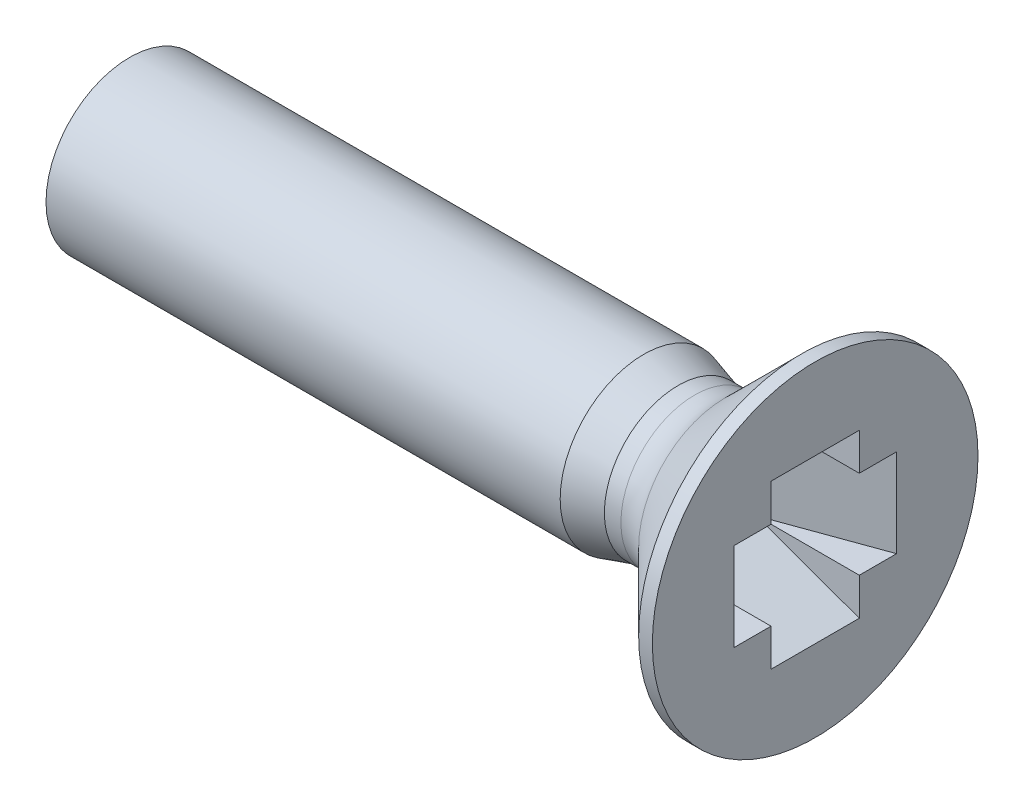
from build123d import *

# Parameters (mm, degrees)
EXTRUSION1_DEPTH = 1.03
EXTRUSION2_DEPTH = 1.03
EXTRUSION3_DEPTH = 1.03
CONG_1_R         = 0.5


with BuildPart() as part:
    # Esquisse1 → R_volution1 (revolve)
    with BuildSketch(Plane(origin=(0, 0, 0), x_dir=(-1, 0, 0), z_dir=(0, 0, -1)), mode=Mode.PRIVATE) as r_volution1_sk:
        Polygon((0, 1.9), (0, 0), (8, 0), (8, 0.975609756), (2, 0.975609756), (1.6, 0.86), (1.2, 0.86), (0.16, 1.9), align=None)
    revolve(r_volution1_sk.sketch.rotate(Axis((0, 0, 0), (-1, 0, 0)), 270), axis=Axis((0, 0, 0), (-1, 0, 0)))

    # Esquisse2 → Extrusion1 (cut)
    with BuildSketch(Plane.XY.offset(0.515)):
        Polygon((0, -0.95), (0, 0.95), (-1.2, 0.515), (-1.2, -0.515), align=None)
    extrude(amount=-EXTRUSION1_DEPTH, mode=Mode.SUBTRACT)

    # Esquisse3 → Extrusion2 (cut)
    with BuildSketch(Plane.XZ.offset(0.515)):
        Polygon((0, 0.515), (0, 0.95), (-1.2, 0.515), align=None)
    extrude(amount=-EXTRUSION2_DEPTH, mode=Mode.SUBTRACT)

    # Esquisse4 → Extrusion3 (cut)
    with BuildSketch(Plane.XZ.offset(0.515)):
        Polygon((-1.2, -0.515), (0, -0.95), (0, -0.515), align=None)
    extrude(amount=-EXTRUSION3_DEPTH, mode=Mode.SUBTRACT)

    # Cong_1
    cong_1_edges = [part.edges().sort_by_distance(p)[0] for p in [
        (-1.2, 0, -0.86),
    ]]
    fillet(cong_1_edges, radius=CONG_1_R)


solid = part.part
